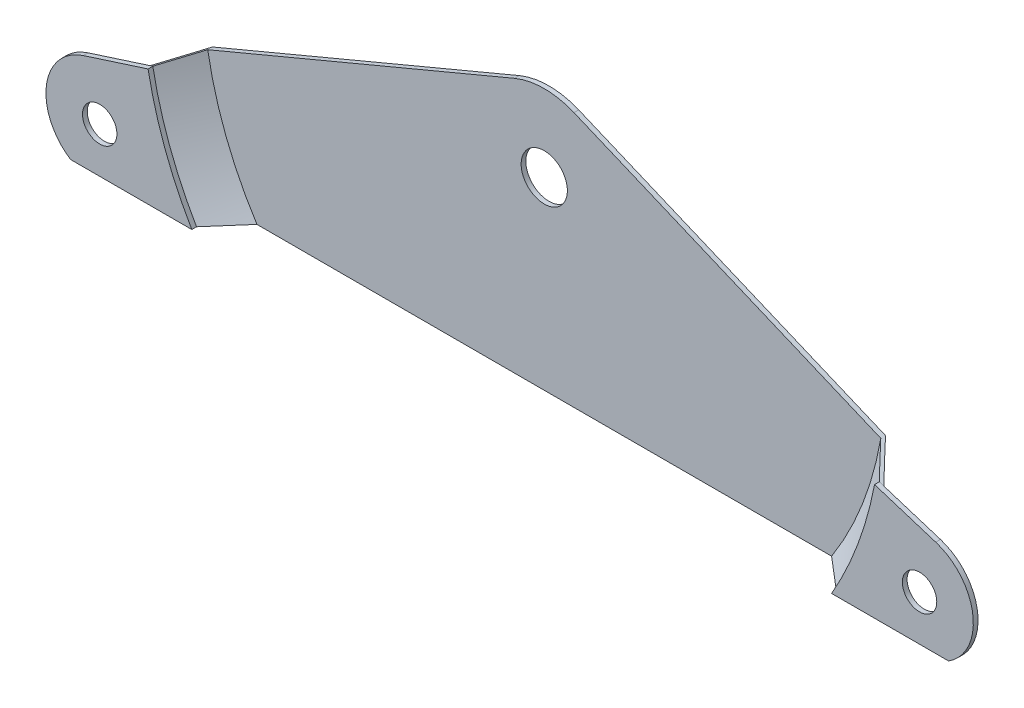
ISO-10303-21;
HEADER;
FILE_DESCRIPTION(('STEP AP214'),'2;1');
FILE_NAME('part.step','',(''),(''),'','','');
FILE_SCHEMA(('AUTOMOTIVE_DESIGN { 1 0 10303 214 1 1 1 1 }'));
ENDSEC;
DATA;
#1=APPLICATION_CONTEXT('core data for automotive mechanical design processes');
#2=APPLICATION_PROTOCOL_DEFINITION('international standard','automotive_design',2000,#1);
#3=PRODUCT_CONTEXT('',#1,'mechanical');
#4=PRODUCT('Part','Part','',(#3));
#5=PRODUCT_RELATED_PRODUCT_CATEGORY('part','',(#4));
#6=PRODUCT_DEFINITION_FORMATION('','',#4);
#7=PRODUCT_DEFINITION_CONTEXT('part definition',#1,'design');
#8=PRODUCT_DEFINITION('design','',#6,#7);
#9=PRODUCT_DEFINITION_SHAPE('','',#8);
#10=(LENGTH_UNIT() NAMED_UNIT(*) SI_UNIT(.MILLI.,.METRE.));
#11=(NAMED_UNIT(*) PLANE_ANGLE_UNIT() SI_UNIT($,.RADIAN.));
#12=(NAMED_UNIT(*) SI_UNIT($,.STERADIAN.) SOLID_ANGLE_UNIT());
#13=UNCERTAINTY_MEASURE_WITH_UNIT(LENGTH_MEASURE(1.E-05),#10,'distance_accuracy_value','');
#14=(GEOMETRIC_REPRESENTATION_CONTEXT(3) GLOBAL_UNCERTAINTY_ASSIGNED_CONTEXT((#13)) GLOBAL_UNIT_ASSIGNED_CONTEXT((#10,
#11,#12)) REPRESENTATION_CONTEXT('',''));
#15=CARTESIAN_POINT('',(0.,0.,0.));
#16=DIRECTION('',(0.,0.,1.));
#17=DIRECTION('',(1.,0.,0.));
#18=AXIS2_PLACEMENT_3D('',#15,#16,#17);
#19=CARTESIAN_POINT('',(0.,17.15,0.44));
#20=DIRECTION('',(0.,0.,1.));
#21=DIRECTION('',(1.,0.,0.));
#22=AXIS2_PLACEMENT_3D('',#19,#20,#21);
#23=PLANE('',#22);
#24=CARTESIAN_POINT('',(0.,17.15,0.44));
#25=DIRECTION('',(0.,0.,1.));
#26=DIRECTION('',(1.,0.,0.));
#27=AXIS2_PLACEMENT_3D('',#24,#25,#26);
#28=CIRCLE('',#27,31.7502897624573);
#29=CARTESIAN_POINT('',(26.72,0.,0.44));
#30=VERTEX_POINT('',#29);
#31=CARTESIAN_POINT('',(31.2934890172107,11.7835817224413,0.44));
#32=VERTEX_POINT('',#31);
#33=EDGE_CURVE('E83',#30,#32,#28,.T.);
#34=ORIENTED_EDGE('',*,*,#33,.T.);
#35=DIRECTION('',(0.922233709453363,-0.386632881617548,0.));
#36=VECTOR('',#35,1.);
#37=CARTESIAN_POINT('',(2.76442510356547,23.7439710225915,0.44));
#38=LINE('',#37,#36);
#39=CARTESIAN_POINT('',(2.76442510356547,23.7439710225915,0.44));
#40=VERTEX_POINT('',#39);
#41=EDGE_CURVE('E319',#40,#32,#38,.T.);
#42=ORIENTED_EDGE('',*,*,#41,.F.);
#43=CARTESIAN_POINT('',(0.,17.15,0.44));
#44=DIRECTION('',(0.,0.,1.));
#45=DIRECTION('',(1.,0.,0.));
#46=AXIS2_PLACEMENT_3D('',#43,#44,#45);
#47=CIRCLE('',#46,7.15);
#48=CARTESIAN_POINT('',(-2.76442510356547,23.7439710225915,0.44));
#49=VERTEX_POINT('',#48);
#50=EDGE_CURVE('E322',#40,#49,#47,.T.);
#51=ORIENTED_EDGE('',*,*,#50,.T.);
#52=DIRECTION('',(-0.922233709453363,-0.386632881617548,0.));
#53=VECTOR('',#52,1.);
#54=CARTESIAN_POINT('',(-2.76442510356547,23.7439710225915,0.44));
#55=LINE('',#54,#53);
#56=CARTESIAN_POINT('',(-31.2934890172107,11.7835817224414,0.44));
#57=VERTEX_POINT('',#56);
#58=EDGE_CURVE('E324',#49,#57,#55,.T.);
#59=ORIENTED_EDGE('',*,*,#58,.T.);
#60=CARTESIAN_POINT('',(0.,17.15,0.44));
#61=DIRECTION('',(0.,0.,1.));
#62=DIRECTION('',(1.,0.,0.));
#63=AXIS2_PLACEMENT_3D('',#60,#61,#62);
#64=CIRCLE('',#63,31.7502897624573);
#65=CARTESIAN_POINT('',(-26.72,0.,0.44));
#66=VERTEX_POINT('',#65);
#67=EDGE_CURVE('E327',#57,#66,#64,.T.);
#68=ORIENTED_EDGE('',*,*,#67,.T.);
#69=DIRECTION('',(1.,0.,0.));
#70=VECTOR('',#69,1.);
#71=CARTESIAN_POINT('',(-26.72,0.,0.44));
#72=LINE('',#71,#70);
#73=EDGE_CURVE('E54',#66,#30,#72,.T.);
#74=ORIENTED_EDGE('',*,*,#73,.T.);
#75=EDGE_LOOP('',(#34,#42,#51,#59,#68,#74));
#76=FACE_BOUND('',#75,.T.);
#77=CARTESIAN_POINT('',(0.,17.15,0.44));
#78=DIRECTION('',(0.,0.,1.));
#79=DIRECTION('',(1.,0.,0.));
#80=AXIS2_PLACEMENT_3D('',#77,#78,#79);
#81=CIRCLE('',#80,2.15);
#82=CARTESIAN_POINT('',(2.15,17.15,0.44));
#83=VERTEX_POINT('',#82);
#84=EDGE_CURVE('E312',#83,#83,#81,.T.);
#85=ORIENTED_EDGE('',*,*,#84,.F.);
#86=EDGE_LOOP('',(#85));
#87=FACE_BOUND('',#86,.T.);
#88=ADVANCED_FACE('F37',(#76,#87),#23,.T.);
#89=CARTESIAN_POINT('',(0.,17.15,0.));
#90=DIRECTION('',(0.,0.,1.));
#91=DIRECTION('',(1.,0.,0.));
#92=AXIS2_PLACEMENT_3D('',#89,#90,#91);
#93=PLANE('',#92);
#94=CARTESIAN_POINT('',(0.,17.15,0.));
#95=DIRECTION('',(0.,0.,1.));
#96=DIRECTION('',(1.,0.,0.));
#97=AXIS2_PLACEMENT_3D('',#94,#95,#96);
#98=CIRCLE('',#97,31.7502897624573);
#99=CARTESIAN_POINT('',(26.72,0.,0.));
#100=VERTEX_POINT('',#99);
#101=CARTESIAN_POINT('',(31.2934890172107,11.7835817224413,0.));
#102=VERTEX_POINT('',#101);
#103=EDGE_CURVE('E315',#100,#102,#98,.T.);
#104=ORIENTED_EDGE('',*,*,#103,.F.);
#105=DIRECTION('',(1.,0.,0.));
#106=VECTOR('',#105,1.);
#107=CARTESIAN_POINT('',(-26.72,0.,0.));
#108=LINE('',#107,#106);
#109=CARTESIAN_POINT('',(-26.72,0.,0.));
#110=VERTEX_POINT('',#109);
#111=EDGE_CURVE('E320',#110,#100,#108,.T.);
#112=ORIENTED_EDGE('',*,*,#111,.F.);
#113=CARTESIAN_POINT('',(0.,17.15,0.));
#114=DIRECTION('',(0.,0.,1.));
#115=DIRECTION('',(1.,0.,0.));
#116=AXIS2_PLACEMENT_3D('',#113,#114,#115);
#117=CIRCLE('',#116,31.7502897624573);
#118=CARTESIAN_POINT('',(-31.2934890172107,11.7835817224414,0.));
#119=VERTEX_POINT('',#118);
#120=EDGE_CURVE('E338',#119,#110,#117,.T.);
#121=ORIENTED_EDGE('',*,*,#120,.F.);
#122=DIRECTION('',(-0.922233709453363,-0.386632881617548,0.));
#123=VECTOR('',#122,1.);
#124=CARTESIAN_POINT('',(-2.76442510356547,23.7439710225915,0.));
#125=LINE('',#124,#123);
#126=CARTESIAN_POINT('',(-2.76442510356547,23.7439710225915,0.));
#127=VERTEX_POINT('',#126);
#128=EDGE_CURVE('E335',#127,#119,#125,.T.);
#129=ORIENTED_EDGE('',*,*,#128,.F.);
#130=CARTESIAN_POINT('',(0.,17.15,0.));
#131=DIRECTION('',(0.,0.,1.));
#132=DIRECTION('',(1.,0.,0.));
#133=AXIS2_PLACEMENT_3D('',#130,#131,#132);
#134=CIRCLE('',#133,7.15);
#135=CARTESIAN_POINT('',(2.76442510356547,23.7439710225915,0.));
#136=VERTEX_POINT('',#135);
#137=EDGE_CURVE('E71',#136,#127,#134,.T.);
#138=ORIENTED_EDGE('',*,*,#137,.F.);
#139=DIRECTION('',(0.922233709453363,-0.386632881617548,0.));
#140=VECTOR('',#139,1.);
#141=CARTESIAN_POINT('',(2.76442510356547,23.7439710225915,0.));
#142=LINE('',#141,#140);
#143=EDGE_CURVE('E332',#136,#102,#142,.T.);
#144=ORIENTED_EDGE('',*,*,#143,.T.);
#145=EDGE_LOOP('',(#104,#112,#121,#129,#138,#144));
#146=FACE_BOUND('',#145,.T.);
#147=CARTESIAN_POINT('',(0.,17.15,0.));
#148=DIRECTION('',(0.,0.,1.));
#149=DIRECTION('',(1.,0.,0.));
#150=AXIS2_PLACEMENT_3D('',#147,#148,#149);
#151=CIRCLE('',#150,2.15);
#152=CARTESIAN_POINT('',(2.15,17.15,0.));
#153=VERTEX_POINT('',#152);
#154=EDGE_CURVE('E303',#153,#153,#151,.T.);
#155=ORIENTED_EDGE('',*,*,#154,.T.);
#156=EDGE_LOOP('',(#155));
#157=FACE_BOUND('',#156,.T.);
#158=ADVANCED_FACE('F347',(#146,#157),#93,.F.);
#159=CARTESIAN_POINT('',(2.76442510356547,23.7439710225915,0.44));
#160=DIRECTION('',(0.386632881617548,0.922233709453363,0.));
#161=DIRECTION('',(-0.922233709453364,0.386632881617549,0.));
#162=AXIS2_PLACEMENT_3D('',#159,#160,#161);
#163=PLANE('',#162);
#164=ORIENTED_EDGE('',*,*,#143,.F.);
#165=DIRECTION('',(0.,0.,-1.));
#166=VECTOR('',#165,1.);
#167=CARTESIAN_POINT('',(2.76442510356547,23.7439710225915,0.44));
#168=LINE('',#167,#166);
#169=EDGE_CURVE('E11',#40,#136,#168,.T.);
#170=ORIENTED_EDGE('',*,*,#169,.F.);
#171=ORIENTED_EDGE('',*,*,#41,.T.);
#172=CARTESIAN_POINT('',(31.2934890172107,11.7835817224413,0.439999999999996));
#173=CARTESIAN_POINT('',(31.3937244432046,11.741559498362,0.547376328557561));
#174=CARTESIAN_POINT('',(31.4940485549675,11.6995000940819,0.654655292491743));
#175=CARTESIAN_POINT('',(31.6948676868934,11.6153096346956,0.869024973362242));
#176=CARTESIAN_POINT('',(31.7953627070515,11.5731785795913,0.976115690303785));
#177=CARTESIAN_POINT('',(31.9965171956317,11.4888475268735,1.19011536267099));
#178=CARTESIAN_POINT('',(32.0971766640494,11.4466475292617,1.2970243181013));
#179=CARTESIAN_POINT('',(32.2986539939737,11.3621811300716,1.51066658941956));
#180=CARTESIAN_POINT('',(32.3994718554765,11.3199147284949,1.61739990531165));
#181=CARTESIAN_POINT('',(32.6012602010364,11.2353179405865,1.83069676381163));
#182=CARTESIAN_POINT('',(32.7022306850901,11.1929875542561,1.9372603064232));
#183=CARTESIAN_POINT('',(32.9043187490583,11.1082651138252,2.15022325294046));
#184=CARTESIAN_POINT('',(33.0054363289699,11.0658730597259,2.25662265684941));
#185=CARTESIAN_POINT('',(33.3090241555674,10.9385983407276,2.57560581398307));
#186=CARTESIAN_POINT('',(33.5117074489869,10.8536263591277,2.78795122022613));
#187=CARTESIAN_POINT('',(33.7146543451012,10.7685438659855,3.));
#188=B_SPLINE_CURVE_WITH_KNOTS('',3,(#172,#173,#174,#175,#176,#177,#178,#179,#180,#181,#182,
#183,#184,#185,#186,#187),.UNSPECIFIED.,.F.,.F.,(4,2,2,2,2,2,2,4),(0.,0.45834929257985,
0.916698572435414,1.37504784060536,1.83339709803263,2.29174634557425,2.75009558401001,
3.66689417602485),.UNSPECIFIED.);
#189=CARTESIAN_POINT('',(33.7146543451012,10.7685438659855,3.));
#190=VERTEX_POINT('',#189);
#191=EDGE_CURVE('E263',#32,#190,#188,.T.);
#192=ORIENTED_EDGE('',*,*,#191,.T.);
#193=DIRECTION('',(0.922233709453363,-0.386632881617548,0.));
#194=VECTOR('',#193,1.);
#195=CARTESIAN_POINT('',(32.0769910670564,11.4551100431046,3.));
#196=LINE('',#195,#194);
#197=CARTESIAN_POINT('',(34.1365470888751,10.5916715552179,3.));
#198=VERTEX_POINT('',#197);
#199=EDGE_CURVE('E247',#190,#198,#196,.T.);
#200=ORIENTED_EDGE('',*,*,#199,.T.);
#201=CARTESIAN_POINT('',(31.2934890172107,11.7835817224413,0.));
#202=CARTESIAN_POINT('',(31.411073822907,11.7342860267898,0.125961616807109));
#203=CARTESIAN_POINT('',(31.528780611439,11.6849391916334,0.251789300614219));
#204=CARTESIAN_POINT('',(31.764427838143,11.5861475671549,0.503187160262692));
#205=CARTESIAN_POINT('',(31.8823682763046,11.5367027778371,0.628757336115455));
#206=CARTESIAN_POINT('',(32.1184724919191,11.4377195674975,0.879650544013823));
#207=CARTESIAN_POINT('',(32.236636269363,11.3881811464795,1.00497357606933));
#208=CARTESIAN_POINT('',(32.4731776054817,11.2890146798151,1.25538218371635));
#209=CARTESIAN_POINT('',(32.5915551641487,11.2393866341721,1.38046775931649));
#210=CARTESIAN_POINT('',(32.8285150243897,11.1400447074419,1.6304106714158));
#211=CARTESIAN_POINT('',(32.9470973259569,11.0903308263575,1.7552680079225));
#212=CARTESIAN_POINT('',(33.1844580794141,10.9908208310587,2.00476323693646));
#213=CARTESIAN_POINT('',(33.3032365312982,10.9410247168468,2.1294011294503));
#214=CARTESIAN_POINT('',(33.6598888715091,10.7915034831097,2.50303405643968));
#215=CARTESIAN_POINT('',(33.8980453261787,10.6916599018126,2.7517120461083));
#216=CARTESIAN_POINT('',(34.1365470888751,10.5916715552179,3.));
#217=B_SPLINE_CURVE_WITH_KNOTS('',3,(#201,#202,#203,#204,#205,#206,#207,#208,#209,#210,#211,
#212,#213,#214,#215,#216),.UNSPECIFIED.,.F.,.F.,(4,2,2,2,2,2,2,4),(0.,0.537683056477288,
1.07536608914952,1.61304910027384,2.15073209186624,2.68841506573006,3.22609802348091,
4.30162011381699),.UNSPECIFIED.);
#218=EDGE_CURVE('E239',#102,#198,#217,.T.);
#219=ORIENTED_EDGE('',*,*,#218,.F.);
#220=EDGE_LOOP('',(#164,#170,#171,#192,#200,#219));
#221=FACE_BOUND('',#220,.T.);
#222=ADVANCED_FACE('F39',(#221),#163,.T.);
#223=CARTESIAN_POINT('',(0.,17.15,0.44));
#224=DIRECTION('',(0.,0.,-1.));
#225=DIRECTION('',(-1.,0.,0.));
#226=AXIS2_PLACEMENT_3D('',#223,#224,#225);
#227=CYLINDRICAL_SURFACE('',#226,7.15);
#228=ORIENTED_EDGE('',*,*,#137,.T.);
#229=DIRECTION('',(0.,0.,-1.));
#230=VECTOR('',#229,1.);
#231=CARTESIAN_POINT('',(-2.76442510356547,23.7439710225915,0.44));
#232=LINE('',#231,#230);
#233=EDGE_CURVE('E46',#49,#127,#232,.T.);
#234=ORIENTED_EDGE('',*,*,#233,.F.);
#235=ORIENTED_EDGE('',*,*,#50,.F.);
#236=ORIENTED_EDGE('',*,*,#169,.T.);
#237=EDGE_LOOP('',(#228,#234,#235,#236));
#238=FACE_BOUND('',#237,.T.);
#239=ADVANCED_FACE('F389',(#238),#227,.T.);
#240=CARTESIAN_POINT('',(-2.76442510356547,23.7439710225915,0.44));
#241=DIRECTION('',(0.386632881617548,-0.922233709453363,0.));
#242=DIRECTION('',(0.922233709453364,0.386632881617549,0.));
#243=AXIS2_PLACEMENT_3D('',#240,#241,#242);
#244=PLANE('',#243);
#245=ORIENTED_EDGE('',*,*,#128,.T.);
#246=CARTESIAN_POINT('',(-31.2934890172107,11.7835817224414,0.));
#247=CARTESIAN_POINT('',(-31.3935358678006,11.741638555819,0.144015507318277));
#248=CARTESIAN_POINT('',(-31.4936968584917,11.6996475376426,0.2879377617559));
#249=CARTESIAN_POINT('',(-31.6942392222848,11.6155731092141,0.575601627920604));
#250=CARTESIAN_POINT('',(-31.7946205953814,11.5734896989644,0.719343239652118));
#251=CARTESIAN_POINT('',(-31.9955958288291,11.4892337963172,1.00665168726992));
#252=CARTESIAN_POINT('',(-32.0961896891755,11.4470613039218,1.15021852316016));
#253=CARTESIAN_POINT('',(-32.2975824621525,11.3626303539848,1.43718298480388));
#254=CARTESIAN_POINT('',(-32.3983813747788,11.3203718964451,1.5805806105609));
#255=CARTESIAN_POINT('',(-32.6001771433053,11.2357719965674,1.8672120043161));
#256=CARTESIAN_POINT('',(-32.7011739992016,11.193430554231,2.01044577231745));
#257=CARTESIAN_POINT('',(-32.9033588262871,11.1086675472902,2.29675460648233));
#258=CARTESIAN_POINT('',(-33.004546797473,11.0662459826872,2.43982967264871));
#259=CARTESIAN_POINT('',(-33.3084084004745,10.9388564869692,2.86885311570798));
#260=CARTESIAN_POINT('',(-33.5113592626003,10.8537723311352,3.1545706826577));
#261=CARTESIAN_POINT('',(-33.7146543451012,10.7685438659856,3.44));
#262=B_SPLINE_CURVE_WITH_KNOTS('',3,(#246,#247,#248,#249,#250,#251,#252,#253,#254,#255,#256,
#257,#258,#259,#260,#261),.UNSPECIFIED.,.F.,.F.,(4,2,2,2,2,2,2,4),(0.,0.540908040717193,
1.08181606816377,1.62272408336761,2.16363208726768,2.70454008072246,3.24544806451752,
4.32737369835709),.UNSPECIFIED.);
#263=CARTESIAN_POINT('',(-33.7146543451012,10.7685438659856,3.44));
#264=VERTEX_POINT('',#263);
#265=EDGE_CURVE('E278',#119,#264,#262,.T.);
#266=ORIENTED_EDGE('',*,*,#265,.T.);
#267=DIRECTION('',(-0.922233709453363,-0.386632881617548,0.));
#268=VECTOR('',#267,1.);
#269=CARTESIAN_POINT('',(-32.0337255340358,11.4732484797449,3.44));
#270=LINE('',#269,#268);
#271=CARTESIAN_POINT('',(-33.4017072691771,10.8997423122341,3.44));
#272=VERTEX_POINT('',#271);
#273=EDGE_CURVE('E284',#272,#264,#270,.T.);
#274=ORIENTED_EDGE('',*,*,#273,.F.);
#275=CARTESIAN_POINT('',(-31.2934890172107,11.7835817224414,0.439999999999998));
#276=CARTESIAN_POINT('',(-31.3806899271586,11.7470240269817,0.565524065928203));
#277=CARTESIAN_POINT('',(-31.4679775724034,11.710429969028,0.690977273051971));
#278=CARTESIAN_POINT('',(-31.6427210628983,11.6371713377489,0.941745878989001));
#279=CARTESIAN_POINT('',(-31.7301769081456,11.6005067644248,1.06706127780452));
#280=CARTESIAN_POINT('',(-31.9052515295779,11.5271093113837,1.31755817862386));
#281=CARTESIAN_POINT('',(-31.9928703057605,11.4903764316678,1.44273968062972));
#282=CARTESIAN_POINT('',(-32.1682657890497,11.4168444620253,1.69297252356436));
#283=CARTESIAN_POINT('',(-32.2560424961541,11.3800453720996,1.81802386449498));
#284=CARTESIAN_POINT('',(-32.4317490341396,11.3063829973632,2.06799999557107));
#285=CARTESIAN_POINT('',(-32.5196788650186,11.2695197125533,2.19292478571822));
#286=CARTESIAN_POINT('',(-32.6956870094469,11.1957308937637,2.44265130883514));
#287=CARTESIAN_POINT('',(-32.7837653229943,11.1588053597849,2.56745304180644));
#288=CARTESIAN_POINT('',(-33.0482303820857,11.0479322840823,2.94169833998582));
#289=CARTESIAN_POINT('',(-33.2248333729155,10.9738940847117,3.19096227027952));
#290=CARTESIAN_POINT('',(-33.4017072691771,10.8997423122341,3.44));
#291=B_SPLINE_CURVE_WITH_KNOTS('',3,(#275,#276,#277,#278,#279,#280,#281,#282,#283,#284,#285,
#286,#287,#288,#289,#290),.UNSPECIFIED.,.F.,.F.,(4,2,2,2,2,2,2,4),(0.,0.471455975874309,
0.94291194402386,1.4143679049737,1.88582385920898,2.35727980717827,2.82873574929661,
3.77172207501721),.UNSPECIFIED.);
#292=EDGE_CURVE('E297',#57,#272,#291,.T.);
#293=ORIENTED_EDGE('',*,*,#292,.F.);
#294=ORIENTED_EDGE('',*,*,#58,.F.);
#295=ORIENTED_EDGE('',*,*,#233,.T.);
#296=EDGE_LOOP('',(#245,#266,#274,#293,#294,#295));
#297=FACE_BOUND('',#296,.T.);
#298=ADVANCED_FACE('F343',(#297),#244,.F.);
#299=CARTESIAN_POINT('',(-26.72,0.,0.44));
#300=DIRECTION('',(0.,1.,0.));
#301=DIRECTION('',(0.,0.,1.));
#302=AXIS2_PLACEMENT_3D('',#299,#300,#301);
#303=PLANE('',#302);
#304=ORIENTED_EDGE('',*,*,#111,.T.);
#305=DIRECTION('',(0.76068664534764,0.,0.649119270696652));
#306=VECTOR('',#305,1.);
#307=CARTESIAN_POINT('',(26.72,0.,0.));
#308=LINE('',#307,#306);
#309=CARTESIAN_POINT('',(30.235625,0.,3.));
#310=VERTEX_POINT('',#309);
#311=EDGE_CURVE('E269',#100,#310,#308,.T.);
#312=ORIENTED_EDGE('',*,*,#311,.T.);
#313=DIRECTION('',(1.,0.,0.));
#314=VECTOR('',#313,1.);
#315=CARTESIAN_POINT('',(29.72,0.,3.));
#316=LINE('',#315,#314);
#317=CARTESIAN_POINT('',(40.606344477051,0.,3.));
#318=VERTEX_POINT('',#317);
#319=EDGE_CURVE('E215',#310,#318,#316,.T.);
#320=ORIENTED_EDGE('',*,*,#319,.T.);
#321=DIRECTION('',(0.,0.,-1.));
#322=VECTOR('',#321,1.);
#323=CARTESIAN_POINT('',(40.606344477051,0.,3.44));
#324=LINE('',#323,#322);
#325=CARTESIAN_POINT('',(40.606344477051,0.,3.44));
#326=VERTEX_POINT('',#325);
#327=EDGE_CURVE('E231',#326,#318,#324,.T.);
#328=ORIENTED_EDGE('',*,*,#327,.F.);
#329=DIRECTION('',(1.,0.,0.));
#330=VECTOR('',#329,1.);
#331=CARTESIAN_POINT('',(29.72,0.,3.44));
#332=LINE('',#331,#330);
#333=CARTESIAN_POINT('',(29.72,0.,3.44));
#334=VERTEX_POINT('',#333);
#335=EDGE_CURVE('E219',#334,#326,#332,.T.);
#336=ORIENTED_EDGE('',*,*,#335,.F.);
#337=DIRECTION('',(0.,0.,-1.));
#338=VECTOR('',#337,1.);
#339=CARTESIAN_POINT('',(29.72,0.,3.44));
#340=LINE('',#339,#338);
#341=CARTESIAN_POINT('',(29.72,0.,3.));
#342=VERTEX_POINT('',#341);
#343=EDGE_CURVE('E227',#334,#342,#340,.T.);
#344=ORIENTED_EDGE('',*,*,#343,.T.);
#345=DIRECTION('',(0.76068664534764,0.,0.649119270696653));
#346=VECTOR('',#345,1.);
#347=CARTESIAN_POINT('',(26.72,0.,0.44));
#348=LINE('',#347,#346);
#349=EDGE_CURVE('E230',#30,#342,#348,.T.);
#350=ORIENTED_EDGE('',*,*,#349,.F.);
#351=ORIENTED_EDGE('',*,*,#73,.F.);
#352=DIRECTION('',(-0.65726286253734,0.,0.753661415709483));
#353=VECTOR('',#352,1.);
#354=CARTESIAN_POINT('',(-26.72,0.,0.44));
#355=LINE('',#354,#353);
#356=CARTESIAN_POINT('',(-29.3362790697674,0.,3.44));
#357=VERTEX_POINT('',#356);
#358=EDGE_CURVE('E164',#66,#357,#355,.T.);
#359=ORIENTED_EDGE('',*,*,#358,.T.);
#360=DIRECTION('',(0.,0.,-1.));
#361=VECTOR('',#360,1.);
#362=CARTESIAN_POINT('',(-29.3362790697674,0.,3.88));
#363=LINE('',#362,#361);
#364=CARTESIAN_POINT('',(-29.3362790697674,0.,3.88));
#365=VERTEX_POINT('',#364);
#366=EDGE_CURVE('E159',#365,#357,#363,.T.);
#367=ORIENTED_EDGE('',*,*,#366,.F.);
#368=DIRECTION('',(-1.,0.,0.));
#369=VECTOR('',#368,1.);
#370=CARTESIAN_POINT('',(-29.3362790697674,0.,3.88));
#371=LINE('',#370,#369);
#372=CARTESIAN_POINT('',(-40.606344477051,0.,3.88));
#373=VERTEX_POINT('',#372);
#374=EDGE_CURVE('E163',#365,#373,#371,.T.);
#375=ORIENTED_EDGE('',*,*,#374,.T.);
#376=DIRECTION('',(0.,0.,-1.));
#377=VECTOR('',#376,1.);
#378=CARTESIAN_POINT('',(-40.606344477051,0.,3.88));
#379=LINE('',#378,#377);
#380=CARTESIAN_POINT('',(-40.606344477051,0.,3.44));
#381=VERTEX_POINT('',#380);
#382=EDGE_CURVE('E168',#373,#381,#379,.T.);
#383=ORIENTED_EDGE('',*,*,#382,.T.);
#384=DIRECTION('',(-1.,0.,0.));
#385=VECTOR('',#384,1.);
#386=CARTESIAN_POINT('',(-29.3362790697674,0.,3.44));
#387=LINE('',#386,#385);
#388=CARTESIAN_POINT('',(-29.72,0.,3.44));
#389=VERTEX_POINT('',#388);
#390=EDGE_CURVE('E194',#389,#381,#387,.T.);
#391=ORIENTED_EDGE('',*,*,#390,.F.);
#392=DIRECTION('',(-0.65726286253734,0.,0.753661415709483));
#393=VECTOR('',#392,1.);
#394=CARTESIAN_POINT('',(-26.72,0.,0.));
#395=LINE('',#394,#393);
#396=EDGE_CURVE('E79',#110,#389,#395,.T.);
#397=ORIENTED_EDGE('',*,*,#396,.F.);
#398=EDGE_LOOP('',(#304,#312,#320,#328,#336,#344,#350,#351,#359,#367,#375,#383,#391,#397));
#399=FACE_BOUND('',#398,.T.);
#400=ADVANCED_FACE('F161',(#399),#303,.F.);
#401=CARTESIAN_POINT('',(0.,17.15,0.44));
#402=DIRECTION('',(0.,0.,-1.));
#403=DIRECTION('',(-1.,0.,0.));
#404=AXIS2_PLACEMENT_3D('',#401,#402,#403);
#405=CYLINDRICAL_SURFACE('',#404,2.15);
#406=ORIENTED_EDGE('',*,*,#84,.T.);
#407=EDGE_LOOP('',(#406));
#408=FACE_BOUND('',#407,.T.);
#409=ORIENTED_EDGE('',*,*,#154,.F.);
#410=EDGE_LOOP('',(#409));
#411=FACE_BOUND('',#410,.T.);
#412=ADVANCED_FACE('F384',(#408,#411),#405,.F.);
#413=DIRECTION('',(-0.577590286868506,0.31366212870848,0.753661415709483));
#414=VECTOR('',#413,1.);
#415=CARTESIAN_POINT('',(-31.665440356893,14.8303476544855,0.44));
#416=LINE('',#415,#414);
#417=CARTESIAN_POINT('',(0.,17.15,0.44));
#418=DIRECTION('',(0.,0.,1.));
#419=AXIS1_PLACEMENT('',#417,#418);
#420=SURFACE_OF_REVOLUTION('',#416,#419);
#421=ORIENTED_EDGE('',*,*,#67,.F.);
#422=ORIENTED_EDGE('',*,*,#292,.T.);
#423=CARTESIAN_POINT('',(0.,17.15,3.44));
#424=DIRECTION('',(0.,0.,1.));
#425=DIRECTION('',(1.,0.,0.));
#426=AXIS2_PLACEMENT_3D('',#423,#424,#425);
#427=CIRCLE('',#426,33.981462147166);
#428=EDGE_CURVE('E285',#272,#357,#427,.T.);
#429=ORIENTED_EDGE('',*,*,#428,.T.);
#430=ORIENTED_EDGE('',*,*,#358,.F.);
#431=EDGE_LOOP('',(#421,#422,#429,#430));
#432=FACE_BOUND('',#431,.T.);
#433=ADVANCED_FACE('F293',(#432),#420,.F.);
#434=DIRECTION('',(-0.577590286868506,0.31366212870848,0.753661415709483));
#435=VECTOR('',#434,1.);
#436=CARTESIAN_POINT('',(-31.665440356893,14.8303476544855,0.));
#437=LINE('',#436,#435);
#438=CARTESIAN_POINT('',(0.,17.15,0.44));
#439=DIRECTION('',(0.,0.,1.));
#440=AXIS1_PLACEMENT('',#438,#439);
#441=SURFACE_OF_REVOLUTION('',#437,#440);
#442=ORIENTED_EDGE('',*,*,#265,.F.);
#443=ORIENTED_EDGE('',*,*,#120,.T.);
#444=ORIENTED_EDGE('',*,*,#396,.T.);
#445=CARTESIAN_POINT('',(0.,17.15,3.44));
#446=DIRECTION('',(0.,0.,1.));
#447=DIRECTION('',(1.,0.,0.));
#448=AXIS2_PLACEMENT_3D('',#445,#446,#447);
#449=CIRCLE('',#448,34.3132758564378);
#450=EDGE_CURVE('E305',#264,#389,#449,.T.);
#451=ORIENTED_EDGE('',*,*,#450,.F.);
#452=EDGE_LOOP('',(#442,#443,#444,#451));
#453=FACE_BOUND('',#452,.T.);
#454=ADVANCED_FACE('F287',(#453),#441,.T.);
#455=DIRECTION('',(0.662869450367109,0.373159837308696,0.649119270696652));
#456=VECTOR('',#455,1.);
#457=CARTESIAN_POINT('',(31.6971029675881,15.3130015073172,0.));
#458=LINE('',#457,#456);
#459=CARTESIAN_POINT('',(0.,17.15,0.44));
#460=DIRECTION('',(0.,0.,-1.));
#461=AXIS1_PLACEMENT('',#459,#460);
#462=SURFACE_OF_REVOLUTION('',#458,#461);
#463=ORIENTED_EDGE('',*,*,#103,.T.);
#464=ORIENTED_EDGE('',*,*,#218,.T.);
#465=CARTESIAN_POINT('',(0.,17.15,3.));
#466=DIRECTION('',(0.,0.,-1.));
#467=DIRECTION('',(-1.,0.,0.));
#468=AXIS2_PLACEMENT_3D('',#465,#466,#467);
#469=CIRCLE('',#468,34.7608331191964);
#470=EDGE_CURVE('E271',#198,#310,#469,.T.);
#471=ORIENTED_EDGE('',*,*,#470,.T.);
#472=ORIENTED_EDGE('',*,*,#311,.F.);
#473=EDGE_LOOP('',(#463,#464,#471,#472));
#474=FACE_BOUND('',#473,.T.);
#475=ADVANCED_FACE('F250',(#474),#462,.F.);
#476=DIRECTION('',(0.662869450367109,0.373159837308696,0.649119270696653));
#477=VECTOR('',#476,1.);
#478=CARTESIAN_POINT('',(31.6971029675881,15.3130015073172,0.44));
#479=LINE('',#478,#477);
#480=CARTESIAN_POINT('',(0.,17.15,0.44));
#481=DIRECTION('',(0.,0.,-1.));
#482=AXIS1_PLACEMENT('',#480,#481);
#483=SURFACE_OF_REVOLUTION('',#479,#482);
#484=ORIENTED_EDGE('',*,*,#191,.F.);
#485=ORIENTED_EDGE('',*,*,#33,.F.);
#486=ORIENTED_EDGE('',*,*,#349,.T.);
#487=CARTESIAN_POINT('',(0.,17.15,3.));
#488=DIRECTION('',(0.,0.,-1.));
#489=DIRECTION('',(-1.,0.,0.));
#490=AXIS2_PLACEMENT_3D('',#487,#488,#489);
#491=CIRCLE('',#490,34.3132758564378);
#492=EDGE_CURVE('E248',#190,#342,#491,.T.);
#493=ORIENTED_EDGE('',*,*,#492,.F.);
#494=EDGE_LOOP('',(#484,#485,#486,#493));
#495=FACE_BOUND('',#494,.T.);
#496=ADVANCED_FACE('F259',(#495),#483,.T.);
#497=CARTESIAN_POINT('',(0.,17.15,3.44));
#498=DIRECTION('',(0.,0.,1.));
#499=DIRECTION('',(1.,0.,0.));
#500=AXIS2_PLACEMENT_3D('',#497,#498,#499);
#501=PLANE('',#500);
#502=CARTESIAN_POINT('',(0.,17.15,3.44));
#503=DIRECTION('',(0.,0.,1.));
#504=DIRECTION('',(1.,0.,0.));
#505=AXIS2_PLACEMENT_3D('',#502,#503,#504);
#506=CIRCLE('',#505,34.3132758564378);
#507=CARTESIAN_POINT('',(33.7146543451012,10.7685438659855,3.44));
#508=VERTEX_POINT('',#507);
#509=EDGE_CURVE('E211',#334,#508,#506,.T.);
#510=ORIENTED_EDGE('',*,*,#509,.F.);
#511=ORIENTED_EDGE('',*,*,#335,.T.);
#512=CARTESIAN_POINT('',(37.9,4.20424780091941,3.44));
#513=DIRECTION('',(0.,0.,1.));
#514=DIRECTION('',(1.,0.,0.));
#515=AXIS2_PLACEMENT_3D('',#512,#513,#514);
#516=CIRCLE('',#515,5.);
#517=CARTESIAN_POINT('',(39.4050656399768,8.97234778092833,3.44));
#518=VERTEX_POINT('',#517);
#519=EDGE_CURVE('E217',#326,#518,#516,.T.);
#520=ORIENTED_EDGE('',*,*,#519,.T.);
#521=DIRECTION('',(-0.953619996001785,0.301013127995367,0.));
#522=VECTOR('',#521,1.);
#523=CARTESIAN_POINT('',(39.4050656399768,8.97234778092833,3.44));
#524=LINE('',#523,#522);
#525=EDGE_CURVE('E214',#518,#508,#524,.T.);
#526=ORIENTED_EDGE('',*,*,#525,.T.);
#527=EDGE_LOOP('',(#510,#511,#520,#526));
#528=FACE_BOUND('',#527,.T.);
#529=CARTESIAN_POINT('',(37.9,4.20424780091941,3.44));
#530=DIRECTION('',(0.,0.,1.));
#531=DIRECTION('',(1.,0.,0.));
#532=AXIS2_PLACEMENT_3D('',#529,#530,#531);
#533=CIRCLE('',#532,1.6);
#534=CARTESIAN_POINT('',(39.5,4.20424780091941,3.44));
#535=VERTEX_POINT('',#534);
#536=EDGE_CURVE('E205',#535,#535,#533,.T.);
#537=ORIENTED_EDGE('',*,*,#536,.F.);
#538=EDGE_LOOP('',(#537));
#539=FACE_BOUND('',#538,.T.);
#540=ADVANCED_FACE('F417',(#528,#539),#501,.T.);
#541=CARTESIAN_POINT('',(0.,17.15,3.));
#542=DIRECTION('',(0.,0.,1.));
#543=DIRECTION('',(1.,0.,0.));
#544=AXIS2_PLACEMENT_3D('',#541,#542,#543);
#545=PLANE('',#544);
#546=ORIENTED_EDGE('',*,*,#199,.F.);
#547=DIRECTION('',(-0.953619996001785,0.301013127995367,0.));
#548=VECTOR('',#547,1.);
#549=CARTESIAN_POINT('',(39.4050656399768,8.97234778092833,3.));
#550=LINE('',#549,#548);
#551=CARTESIAN_POINT('',(39.4050656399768,8.97234778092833,3.));
#552=VERTEX_POINT('',#551);
#553=EDGE_CURVE('E208',#552,#190,#550,.T.);
#554=ORIENTED_EDGE('',*,*,#553,.F.);
#555=CARTESIAN_POINT('',(37.9,4.20424780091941,3.));
#556=DIRECTION('',(0.,0.,1.));
#557=DIRECTION('',(1.,0.,0.));
#558=AXIS2_PLACEMENT_3D('',#555,#556,#557);
#559=CIRCLE('',#558,5.);
#560=EDGE_CURVE('E224',#318,#552,#559,.T.);
#561=ORIENTED_EDGE('',*,*,#560,.F.);
#562=ORIENTED_EDGE('',*,*,#319,.F.);
#563=ORIENTED_EDGE('',*,*,#470,.F.);
#564=EDGE_LOOP('',(#546,#554,#561,#562,#563));
#565=FACE_BOUND('',#564,.T.);
#566=CARTESIAN_POINT('',(37.9,4.20424780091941,3.));
#567=DIRECTION('',(0.,0.,1.));
#568=DIRECTION('',(1.,0.,0.));
#569=AXIS2_PLACEMENT_3D('',#566,#567,#568);
#570=CIRCLE('',#569,1.6);
#571=CARTESIAN_POINT('',(39.5,4.20424780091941,3.));
#572=VERTEX_POINT('',#571);
#573=EDGE_CURVE('E200',#572,#572,#570,.T.);
#574=ORIENTED_EDGE('',*,*,#573,.T.);
#575=EDGE_LOOP('',(#574));
#576=FACE_BOUND('',#575,.T.);
#577=ADVANCED_FACE('F404',(#565,#576),#545,.F.);
#578=CARTESIAN_POINT('',(0.,17.15,3.44));
#579=DIRECTION('',(0.,0.,-1.));
#580=DIRECTION('',(-1.,0.,0.));
#581=AXIS2_PLACEMENT_3D('',#578,#579,#580);
#582=CYLINDRICAL_SURFACE('',#581,34.3132758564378);
#583=ORIENTED_EDGE('',*,*,#492,.T.);
#584=ORIENTED_EDGE('',*,*,#343,.F.);
#585=ORIENTED_EDGE('',*,*,#509,.T.);
#586=DIRECTION('',(0.,0.,-1.));
#587=VECTOR('',#586,1.);
#588=CARTESIAN_POINT('',(33.7146543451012,10.7685438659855,3.44));
#589=LINE('',#588,#587);
#590=EDGE_CURVE('E221',#508,#190,#589,.T.);
#591=ORIENTED_EDGE('',*,*,#590,.T.);
#592=EDGE_LOOP('',(#583,#584,#585,#591));
#593=FACE_BOUND('',#592,.T.);
#594=ADVANCED_FACE('F257',(#593),#582,.F.);
#595=CARTESIAN_POINT('',(37.9,4.20424780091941,3.44));
#596=DIRECTION('',(0.,0.,-1.));
#597=DIRECTION('',(-1.,0.,0.));
#598=AXIS2_PLACEMENT_3D('',#595,#596,#597);
#599=CYLINDRICAL_SURFACE('',#598,5.);
#600=ORIENTED_EDGE('',*,*,#560,.T.);
#601=DIRECTION('',(0.,0.,-1.));
#602=VECTOR('',#601,1.);
#603=CARTESIAN_POINT('',(39.4050656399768,8.97234778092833,3.44));
#604=LINE('',#603,#602);
#605=EDGE_CURVE('E234',#518,#552,#604,.T.);
#606=ORIENTED_EDGE('',*,*,#605,.F.);
#607=ORIENTED_EDGE('',*,*,#519,.F.);
#608=ORIENTED_EDGE('',*,*,#327,.T.);
#609=EDGE_LOOP('',(#600,#606,#607,#608));
#610=FACE_BOUND('',#609,.T.);
#611=ADVANCED_FACE('F412',(#610),#599,.T.);
#612=CARTESIAN_POINT('',(39.4050656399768,8.97234778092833,3.44));
#613=DIRECTION('',(-0.301013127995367,-0.953619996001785,0.));
#614=DIRECTION('',(0.953619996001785,-0.301013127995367,0.));
#615=AXIS2_PLACEMENT_3D('',#612,#613,#614);
#616=PLANE('',#615);
#617=ORIENTED_EDGE('',*,*,#553,.T.);
#618=ORIENTED_EDGE('',*,*,#590,.F.);
#619=ORIENTED_EDGE('',*,*,#525,.F.);
#620=ORIENTED_EDGE('',*,*,#605,.T.);
#621=EDGE_LOOP('',(#617,#618,#619,#620));
#622=FACE_BOUND('',#621,.T.);
#623=ADVANCED_FACE('F466',(#622),#616,.F.);
#624=CARTESIAN_POINT('',(37.9,4.20424780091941,3.44));
#625=DIRECTION('',(0.,0.,-1.));
#626=DIRECTION('',(-1.,0.,0.));
#627=AXIS2_PLACEMENT_3D('',#624,#625,#626);
#628=CYLINDRICAL_SURFACE('',#627,1.6);
#629=ORIENTED_EDGE('',*,*,#536,.T.);
#630=EDGE_LOOP('',(#629));
#631=FACE_BOUND('',#630,.T.);
#632=ORIENTED_EDGE('',*,*,#573,.F.);
#633=EDGE_LOOP('',(#632));
#634=FACE_BOUND('',#633,.T.);
#635=ADVANCED_FACE('F461',(#631,#634),#628,.F.);
#636=CARTESIAN_POINT('',(0.,17.15,3.88));
#637=DIRECTION('',(0.,0.,1.));
#638=DIRECTION('',(1.,0.,0.));
#639=AXIS2_PLACEMENT_3D('',#636,#637,#638);
#640=PLANE('',#639);
#641=CARTESIAN_POINT('',(0.,17.15,3.88));
#642=DIRECTION('',(0.,0.,1.));
#643=DIRECTION('',(1.,0.,0.));
#644=AXIS2_PLACEMENT_3D('',#641,#642,#643);
#645=CIRCLE('',#644,33.981462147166);
#646=CARTESIAN_POINT('',(-33.4017072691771,10.8997423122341,3.88));
#647=VERTEX_POINT('',#646);
#648=EDGE_CURVE('E175',#647,#365,#645,.T.);
#649=ORIENTED_EDGE('',*,*,#648,.F.);
#650=DIRECTION('',(-0.952135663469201,-0.305675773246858,0.));
#651=VECTOR('',#650,1.);
#652=CARTESIAN_POINT('',(-33.4017072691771,10.8997423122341,3.88));
#653=LINE('',#652,#651);
#654=CARTESIAN_POINT('',(-39.4283788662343,8.96492611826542,3.88));
#655=VERTEX_POINT('',#654);
#656=EDGE_CURVE('E169',#647,#655,#653,.T.);
#657=ORIENTED_EDGE('',*,*,#656,.T.);
#658=CARTESIAN_POINT('',(-37.9,4.2042478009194,3.88));
#659=DIRECTION('',(0.,0.,1.));
#660=DIRECTION('',(1.,0.,0.));
#661=AXIS2_PLACEMENT_3D('',#658,#659,#660);
#662=CIRCLE('',#661,5.00000000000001);
#663=EDGE_CURVE('E177',#655,#373,#662,.T.);
#664=ORIENTED_EDGE('',*,*,#663,.T.);
#665=ORIENTED_EDGE('',*,*,#374,.F.);
#666=EDGE_LOOP('',(#649,#657,#664,#665));
#667=FACE_BOUND('',#666,.T.);
#668=CARTESIAN_POINT('',(-37.9,4.2042478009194,3.88));
#669=DIRECTION('',(0.,0.,1.));
#670=DIRECTION('',(1.,0.,0.));
#671=AXIS2_PLACEMENT_3D('',#668,#669,#670);
#672=CIRCLE('',#671,1.6);
#673=CARTESIAN_POINT('',(-36.3,4.2042478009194,3.88));
#674=VERTEX_POINT('',#673);
#675=EDGE_CURVE('E196',#674,#674,#672,.T.);
#676=ORIENTED_EDGE('',*,*,#675,.F.);
#677=EDGE_LOOP('',(#676));
#678=FACE_BOUND('',#677,.T.);
#679=ADVANCED_FACE('F173',(#667,#678),#640,.T.);
#680=CARTESIAN_POINT('',(0.,17.15,3.44));
#681=DIRECTION('',(0.,0.,1.));
#682=DIRECTION('',(1.,0.,0.));
#683=AXIS2_PLACEMENT_3D('',#680,#681,#682);
#684=PLANE('',#683);
#685=DIRECTION('',(-0.952135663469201,-0.305675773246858,0.));
#686=VECTOR('',#685,1.);
#687=CARTESIAN_POINT('',(-33.4017072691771,10.8997423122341,3.44));
#688=LINE('',#687,#686);
#689=CARTESIAN_POINT('',(-39.4283788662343,8.96492611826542,3.44));
#690=VERTEX_POINT('',#689);
#691=EDGE_CURVE('E184',#272,#690,#688,.T.);
#692=ORIENTED_EDGE('',*,*,#691,.F.);
#693=ORIENTED_EDGE('',*,*,#273,.T.);
#694=ORIENTED_EDGE('',*,*,#450,.T.);
#695=ORIENTED_EDGE('',*,*,#390,.T.);
#696=CARTESIAN_POINT('',(-37.9,4.2042478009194,3.44));
#697=DIRECTION('',(0.,0.,1.));
#698=DIRECTION('',(1.,0.,0.));
#699=AXIS2_PLACEMENT_3D('',#696,#697,#698);
#700=CIRCLE('',#699,5.00000000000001);
#701=EDGE_CURVE('E186',#690,#381,#700,.T.);
#702=ORIENTED_EDGE('',*,*,#701,.F.);
#703=EDGE_LOOP('',(#692,#693,#694,#695,#702));
#704=FACE_BOUND('',#703,.T.);
#705=CARTESIAN_POINT('',(-37.9,4.2042478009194,3.44));
#706=DIRECTION('',(0.,0.,1.));
#707=DIRECTION('',(1.,0.,0.));
#708=AXIS2_PLACEMENT_3D('',#705,#706,#707);
#709=CIRCLE('',#708,1.6);
#710=CARTESIAN_POINT('',(-36.3,4.2042478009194,3.44));
#711=VERTEX_POINT('',#710);
#712=EDGE_CURVE('E189',#711,#711,#709,.T.);
#713=ORIENTED_EDGE('',*,*,#712,.T.);
#714=EDGE_LOOP('',(#713));
#715=FACE_BOUND('',#714,.T.);
#716=ADVANCED_FACE('F362',(#704,#715),#684,.F.);
#717=CARTESIAN_POINT('',(0.,17.15,3.88));
#718=DIRECTION('',(0.,0.,-1.));
#719=DIRECTION('',(-1.,0.,0.));
#720=AXIS2_PLACEMENT_3D('',#717,#718,#719);
#721=CYLINDRICAL_SURFACE('',#720,33.981462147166);
#722=ORIENTED_EDGE('',*,*,#428,.F.);
#723=DIRECTION('',(0.,0.,-1.));
#724=VECTOR('',#723,1.);
#725=CARTESIAN_POINT('',(-33.4017072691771,10.8997423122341,3.88));
#726=LINE('',#725,#724);
#727=EDGE_CURVE('E182',#647,#272,#726,.T.);
#728=ORIENTED_EDGE('',*,*,#727,.F.);
#729=ORIENTED_EDGE('',*,*,#648,.T.);
#730=ORIENTED_EDGE('',*,*,#366,.T.);
#731=EDGE_LOOP('',(#722,#728,#729,#730));
#732=FACE_BOUND('',#731,.T.);
#733=ADVANCED_FACE('F180',(#732),#721,.F.);
#734=CARTESIAN_POINT('',(-33.4017072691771,10.8997423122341,3.88));
#735=DIRECTION('',(0.305675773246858,-0.952135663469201,0.));
#736=DIRECTION('',(0.952135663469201,0.305675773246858,0.));
#737=AXIS2_PLACEMENT_3D('',#734,#735,#736);
#738=PLANE('',#737);
#739=ORIENTED_EDGE('',*,*,#691,.T.);
#740=DIRECTION('',(0.,0.,-1.));
#741=VECTOR('',#740,1.);
#742=CARTESIAN_POINT('',(-39.4283788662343,8.96492611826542,3.88));
#743=LINE('',#742,#741);
#744=EDGE_CURVE('E201',#655,#690,#743,.T.);
#745=ORIENTED_EDGE('',*,*,#744,.F.);
#746=ORIENTED_EDGE('',*,*,#656,.F.);
#747=ORIENTED_EDGE('',*,*,#727,.T.);
#748=EDGE_LOOP('',(#739,#745,#746,#747));
#749=FACE_BOUND('',#748,.T.);
#750=ADVANCED_FACE('F359',(#749),#738,.F.);
#751=CARTESIAN_POINT('',(-37.9,4.2042478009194,3.88));
#752=DIRECTION('',(0.,0.,-1.));
#753=DIRECTION('',(-1.,0.,0.));
#754=AXIS2_PLACEMENT_3D('',#751,#752,#753);
#755=CYLINDRICAL_SURFACE('',#754,5.00000000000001);
#756=ORIENTED_EDGE('',*,*,#701,.T.);
#757=ORIENTED_EDGE('',*,*,#382,.F.);
#758=ORIENTED_EDGE('',*,*,#663,.F.);
#759=ORIENTED_EDGE('',*,*,#744,.T.);
#760=EDGE_LOOP('',(#756,#757,#758,#759));
#761=FACE_BOUND('',#760,.T.);
#762=ADVANCED_FACE('F365',(#761),#755,.T.);
#763=CARTESIAN_POINT('',(-37.9,4.2042478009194,3.88));
#764=DIRECTION('',(0.,0.,-1.));
#765=DIRECTION('',(-1.,0.,0.));
#766=AXIS2_PLACEMENT_3D('',#763,#764,#765);
#767=CYLINDRICAL_SURFACE('',#766,1.6);
#768=ORIENTED_EDGE('',*,*,#675,.T.);
#769=EDGE_LOOP('',(#768));
#770=FACE_BOUND('',#769,.T.);
#771=ORIENTED_EDGE('',*,*,#712,.F.);
#772=EDGE_LOOP('',(#771));
#773=FACE_BOUND('',#772,.T.);
#774=ADVANCED_FACE('F367',(#770,#773),#767,.F.);
#775=CLOSED_SHELL('',(#88,#158,#222,#239,#298,#400,#412,#433,#454,#475,#496,#540,#577,#594,#611,
#623,#635,#679,#716,#733,#750,#762,#774));
#776=MANIFOLD_SOLID_BREP('B2',#775);
#777=ADVANCED_BREP_SHAPE_REPRESENTATION('',(#18,#776),#14);
#778=SHAPE_DEFINITION_REPRESENTATION(#9,#777);
ENDSEC;
END-ISO-10303-21;
